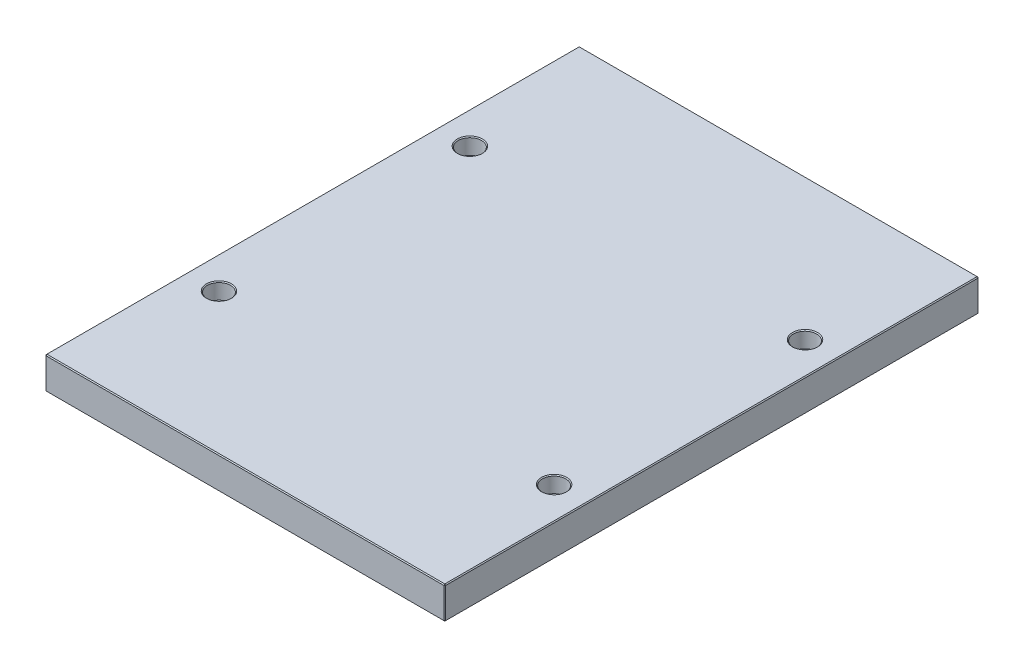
ISO-10303-21;
HEADER;
FILE_DESCRIPTION(('STEP AP214'),'2;1');
FILE_NAME('part.step','',(''),(''),'','','');
FILE_SCHEMA(('AUTOMOTIVE_DESIGN { 1 0 10303 214 1 1 1 1 }'));
ENDSEC;
DATA;
#1=APPLICATION_CONTEXT('core data for automotive mechanical design processes');
#2=APPLICATION_PROTOCOL_DEFINITION('international standard','automotive_design',2000,#1);
#3=PRODUCT_CONTEXT('',#1,'mechanical');
#4=PRODUCT('Part','Part','',(#3));
#5=PRODUCT_RELATED_PRODUCT_CATEGORY('part','',(#4));
#6=PRODUCT_DEFINITION_FORMATION('','',#4);
#7=PRODUCT_DEFINITION_CONTEXT('part definition',#1,'design');
#8=PRODUCT_DEFINITION('design','',#6,#7);
#9=PRODUCT_DEFINITION_SHAPE('','',#8);
#10=(LENGTH_UNIT() NAMED_UNIT(*) SI_UNIT(.MILLI.,.METRE.));
#11=(NAMED_UNIT(*) PLANE_ANGLE_UNIT() SI_UNIT($,.RADIAN.));
#12=(NAMED_UNIT(*) SI_UNIT($,.STERADIAN.) SOLID_ANGLE_UNIT());
#13=UNCERTAINTY_MEASURE_WITH_UNIT(LENGTH_MEASURE(1.E-05),#10,'distance_accuracy_value','');
#14=(GEOMETRIC_REPRESENTATION_CONTEXT(3) GLOBAL_UNCERTAINTY_ASSIGNED_CONTEXT((#13)) GLOBAL_UNIT_ASSIGNED_CONTEXT((#10,
#11,#12)) REPRESENTATION_CONTEXT('',''));
#15=CARTESIAN_POINT('',(0.,0.,0.));
#16=DIRECTION('',(0.,0.,1.));
#17=DIRECTION('',(1.,0.,0.));
#18=AXIS2_PLACEMENT_3D('',#15,#16,#17);
#19=CARTESIAN_POINT('',(-223.,36.,298.));
#20=DIRECTION('',(1.,0.,0.));
#21=DIRECTION('',(0.,0.,-1.));
#22=AXIS2_PLACEMENT_3D('',#19,#20,#21);
#23=PLANE('',#22);
#24=DIRECTION('',(0.,-1.,0.));
#25=VECTOR('',#24,1.);
#26=CARTESIAN_POINT('',(-223.,36.,-297.));
#27=LINE('',#26,#25);
#28=CARTESIAN_POINT('',(-223.,35.,-297.));
#29=VERTEX_POINT('',#28);
#30=CARTESIAN_POINT('',(-223.,1.00000000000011,-297.));
#31=VERTEX_POINT('',#30);
#32=EDGE_CURVE('E115',#29,#31,#27,.T.);
#33=ORIENTED_EDGE('',*,*,#32,.T.);
#34=DIRECTION('',(0.,0.,1.));
#35=VECTOR('',#34,1.);
#36=CARTESIAN_POINT('',(-223.,1.00000000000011,298.));
#37=LINE('',#36,#35);
#38=CARTESIAN_POINT('',(-223.,1.00000000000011,297.));
#39=VERTEX_POINT('',#38);
#40=EDGE_CURVE('E111',#31,#39,#37,.T.);
#41=ORIENTED_EDGE('',*,*,#40,.T.);
#42=DIRECTION('',(0.,1.,0.));
#43=VECTOR('',#42,1.);
#44=CARTESIAN_POINT('',(-223.,36.,297.));
#45=LINE('',#44,#43);
#46=CARTESIAN_POINT('',(-223.,35.,297.));
#47=VERTEX_POINT('',#46);
#48=EDGE_CURVE('E104',#39,#47,#45,.T.);
#49=ORIENTED_EDGE('',*,*,#48,.T.);
#50=DIRECTION('',(0.,0.,-1.));
#51=VECTOR('',#50,1.);
#52=CARTESIAN_POINT('',(-223.,35.,-298.));
#53=LINE('',#52,#51);
#54=EDGE_CURVE('E108',#47,#29,#53,.T.);
#55=ORIENTED_EDGE('',*,*,#54,.T.);
#56=EDGE_LOOP('',(#33,#41,#49,#55));
#57=FACE_BOUND('',#56,.T.);
#58=ADVANCED_FACE('F16',(#57),#23,.F.);
#59=CARTESIAN_POINT('',(223.,36.,298.));
#60=DIRECTION('',(0.,0.,-1.));
#61=DIRECTION('',(-1.,0.,0.));
#62=AXIS2_PLACEMENT_3D('',#59,#60,#61);
#63=PLANE('',#62);
#64=DIRECTION('',(-1.,0.,0.));
#65=VECTOR('',#64,1.);
#66=CARTESIAN_POINT('',(-223.,35.,298.));
#67=LINE('',#66,#65);
#68=CARTESIAN_POINT('',(222.,35.,298.));
#69=VERTEX_POINT('',#68);
#70=CARTESIAN_POINT('',(-222.,35.,298.));
#71=VERTEX_POINT('',#70);
#72=EDGE_CURVE('E170',#69,#71,#67,.T.);
#73=ORIENTED_EDGE('',*,*,#72,.T.);
#74=DIRECTION('',(0.,-1.,0.));
#75=VECTOR('',#74,1.);
#76=CARTESIAN_POINT('',(-222.,36.,298.));
#77=LINE('',#76,#75);
#78=CARTESIAN_POINT('',(-222.,1.,298.));
#79=VERTEX_POINT('',#78);
#80=EDGE_CURVE('E123',#71,#79,#77,.T.);
#81=ORIENTED_EDGE('',*,*,#80,.T.);
#82=DIRECTION('',(1.,0.,0.));
#83=VECTOR('',#82,1.);
#84=CARTESIAN_POINT('',(223.,1.,298.));
#85=LINE('',#84,#83);
#86=CARTESIAN_POINT('',(222.,1.,298.));
#87=VERTEX_POINT('',#86);
#88=EDGE_CURVE('E174',#79,#87,#85,.T.);
#89=ORIENTED_EDGE('',*,*,#88,.T.);
#90=DIRECTION('',(0.,1.,0.));
#91=VECTOR('',#90,1.);
#92=CARTESIAN_POINT('',(222.,36.,298.));
#93=LINE('',#92,#91);
#94=EDGE_CURVE('E172',#87,#69,#93,.T.);
#95=ORIENTED_EDGE('',*,*,#94,.T.);
#96=EDGE_LOOP('',(#73,#81,#89,#95));
#97=FACE_BOUND('',#96,.T.);
#98=ADVANCED_FACE('F317',(#97),#63,.F.);
#99=CARTESIAN_POINT('',(223.,36.,298.));
#100=DIRECTION('',(-1.,0.,0.));
#101=DIRECTION('',(0.,0.,1.));
#102=AXIS2_PLACEMENT_3D('',#99,#100,#101);
#103=PLANE('',#102);
#104=DIRECTION('',(0.,0.,-1.));
#105=VECTOR('',#104,1.);
#106=CARTESIAN_POINT('',(223.,1.,298.));
#107=LINE('',#106,#105);
#108=CARTESIAN_POINT('',(223.,1.,297.));
#109=VERTEX_POINT('',#108);
#110=CARTESIAN_POINT('',(223.,1.,-297.));
#111=VERTEX_POINT('',#110);
#112=EDGE_CURVE('E165',#109,#111,#107,.T.);
#113=ORIENTED_EDGE('',*,*,#112,.T.);
#114=DIRECTION('',(0.,1.,0.));
#115=VECTOR('',#114,1.);
#116=CARTESIAN_POINT('',(223.,36.,-297.));
#117=LINE('',#116,#115);
#118=CARTESIAN_POINT('',(223.,35.,-297.));
#119=VERTEX_POINT('',#118);
#120=EDGE_CURVE('E167',#111,#119,#117,.T.);
#121=ORIENTED_EDGE('',*,*,#120,.T.);
#122=DIRECTION('',(0.,0.,1.));
#123=VECTOR('',#122,1.);
#124=CARTESIAN_POINT('',(223.,35.,298.));
#125=LINE('',#124,#123);
#126=CARTESIAN_POINT('',(223.,35.,297.));
#127=VERTEX_POINT('',#126);
#128=EDGE_CURVE('E161',#119,#127,#125,.T.);
#129=ORIENTED_EDGE('',*,*,#128,.T.);
#130=DIRECTION('',(0.,-1.,0.));
#131=VECTOR('',#130,1.);
#132=CARTESIAN_POINT('',(223.,36.,297.));
#133=LINE('',#132,#131);
#134=EDGE_CURVE('E163',#127,#109,#133,.T.);
#135=ORIENTED_EDGE('',*,*,#134,.T.);
#136=EDGE_LOOP('',(#113,#121,#129,#135));
#137=FACE_BOUND('',#136,.T.);
#138=ADVANCED_FACE('F323',(#137),#103,.F.);
#139=CARTESIAN_POINT('',(223.,36.,-298.));
#140=DIRECTION('',(0.,0.,1.));
#141=DIRECTION('',(1.,0.,0.));
#142=AXIS2_PLACEMENT_3D('',#139,#140,#141);
#143=PLANE('',#142);
#144=DIRECTION('',(0.,-1.,0.));
#145=VECTOR('',#144,1.);
#146=CARTESIAN_POINT('',(222.,36.,-298.));
#147=LINE('',#146,#145);
#148=CARTESIAN_POINT('',(222.,35.,-298.));
#149=VERTEX_POINT('',#148);
#150=CARTESIAN_POINT('',(222.,1.,-298.));
#151=VERTEX_POINT('',#150);
#152=EDGE_CURVE('E154',#149,#151,#147,.T.);
#153=ORIENTED_EDGE('',*,*,#152,.T.);
#154=DIRECTION('',(-1.,0.,0.));
#155=VECTOR('',#154,1.);
#156=CARTESIAN_POINT('',(223.,1.,-298.));
#157=LINE('',#156,#155);
#158=CARTESIAN_POINT('',(-222.,1.,-298.));
#159=VERTEX_POINT('',#158);
#160=EDGE_CURVE('E159',#151,#159,#157,.T.);
#161=ORIENTED_EDGE('',*,*,#160,.T.);
#162=DIRECTION('',(0.,1.,0.));
#163=VECTOR('',#162,1.);
#164=CARTESIAN_POINT('',(-222.,36.,-298.));
#165=LINE('',#164,#163);
#166=CARTESIAN_POINT('',(-222.,35.,-298.));
#167=VERTEX_POINT('',#166);
#168=EDGE_CURVE('E156',#159,#167,#165,.T.);
#169=ORIENTED_EDGE('',*,*,#168,.T.);
#170=DIRECTION('',(1.,0.,0.));
#171=VECTOR('',#170,1.);
#172=CARTESIAN_POINT('',(223.,35.,-298.));
#173=LINE('',#172,#171);
#174=EDGE_CURVE('E152',#167,#149,#173,.T.);
#175=ORIENTED_EDGE('',*,*,#174,.T.);
#176=EDGE_LOOP('',(#153,#161,#169,#175));
#177=FACE_BOUND('',#176,.T.);
#178=ADVANCED_FACE('F465',(#177),#143,.F.);
#179=CARTESIAN_POINT('',(0.,36.,0.));
#180=DIRECTION('',(0.,1.,0.));
#181=DIRECTION('',(0.,0.,1.));
#182=AXIS2_PLACEMENT_3D('',#179,#180,#181);
#183=PLANE('',#182);
#184=CARTESIAN_POINT('',(-187.,36.,140.));
#185=DIRECTION('',(0.,1.,0.));
#186=DIRECTION('',(0.,0.,1.));
#187=AXIS2_PLACEMENT_3D('',#184,#185,#186);
#188=CIRCLE('',#187,14.);
#189=CARTESIAN_POINT('',(-187.,36.,154.));
#190=VERTEX_POINT('',#189);
#191=EDGE_CURVE('E290',#190,#190,#188,.F.);
#192=ORIENTED_EDGE('',*,*,#191,.T.);
#193=EDGE_LOOP('',(#192));
#194=FACE_BOUND('',#193,.T.);
#195=CARTESIAN_POINT('',(187.,36.,140.));
#196=DIRECTION('',(0.,1.,0.));
#197=DIRECTION('',(0.,0.,1.));
#198=AXIS2_PLACEMENT_3D('',#195,#196,#197);
#199=CIRCLE('',#198,14.);
#200=CARTESIAN_POINT('',(187.,36.,154.));
#201=VERTEX_POINT('',#200);
#202=EDGE_CURVE('E287',#201,#201,#199,.F.);
#203=ORIENTED_EDGE('',*,*,#202,.T.);
#204=EDGE_LOOP('',(#203));
#205=FACE_BOUND('',#204,.T.);
#206=CARTESIAN_POINT('',(187.,36.,-140.));
#207=DIRECTION('',(0.,1.,0.));
#208=DIRECTION('',(0.,0.,1.));
#209=AXIS2_PLACEMENT_3D('',#206,#207,#208);
#210=CIRCLE('',#209,14.);
#211=CARTESIAN_POINT('',(187.,36.,-126.));
#212=VERTEX_POINT('',#211);
#213=EDGE_CURVE('E284',#212,#212,#210,.F.);
#214=ORIENTED_EDGE('',*,*,#213,.T.);
#215=EDGE_LOOP('',(#214));
#216=FACE_BOUND('',#215,.T.);
#217=CARTESIAN_POINT('',(-187.,36.,-140.));
#218=DIRECTION('',(0.,1.,0.));
#219=DIRECTION('',(0.,0.,1.));
#220=AXIS2_PLACEMENT_3D('',#217,#218,#219);
#221=CIRCLE('',#220,14.);
#222=CARTESIAN_POINT('',(-187.,36.,-126.));
#223=VERTEX_POINT('',#222);
#224=EDGE_CURVE('E281',#223,#223,#221,.F.);
#225=ORIENTED_EDGE('',*,*,#224,.T.);
#226=EDGE_LOOP('',(#225));
#227=FACE_BOUND('',#226,.T.);
#228=DIRECTION('',(0.,0.,-1.));
#229=VECTOR('',#228,1.);
#230=CARTESIAN_POINT('',(222.,36.,-298.));
#231=LINE('',#230,#229);
#232=CARTESIAN_POINT('',(222.,36.,297.));
#233=VERTEX_POINT('',#232);
#234=CARTESIAN_POINT('',(222.,36.,-297.));
#235=VERTEX_POINT('',#234);
#236=EDGE_CURVE('E31',#233,#235,#231,.T.);
#237=ORIENTED_EDGE('',*,*,#236,.T.);
#238=DIRECTION('',(-1.,0.,0.));
#239=VECTOR('',#238,1.);
#240=CARTESIAN_POINT('',(-223.,36.,-297.));
#241=LINE('',#240,#239);
#242=CARTESIAN_POINT('',(-222.,36.,-297.));
#243=VERTEX_POINT('',#242);
#244=EDGE_CURVE('E190',#235,#243,#241,.T.);
#245=ORIENTED_EDGE('',*,*,#244,.T.);
#246=DIRECTION('',(0.,0.,1.));
#247=VECTOR('',#246,1.);
#248=CARTESIAN_POINT('',(-222.,36.,298.));
#249=LINE('',#248,#247);
#250=CARTESIAN_POINT('',(-222.,36.,297.));
#251=VERTEX_POINT('',#250);
#252=EDGE_CURVE('E186',#243,#251,#249,.T.);
#253=ORIENTED_EDGE('',*,*,#252,.T.);
#254=DIRECTION('',(1.,0.,0.));
#255=VECTOR('',#254,1.);
#256=CARTESIAN_POINT('',(223.,36.,297.));
#257=LINE('',#256,#255);
#258=EDGE_CURVE('E36',#251,#233,#257,.T.);
#259=ORIENTED_EDGE('',*,*,#258,.T.);
#260=EDGE_LOOP('',(#237,#245,#253,#259));
#261=FACE_BOUND('',#260,.T.);
#262=ADVANCED_FACE('F462',(#194,#205,#216,#227,#261),#183,.T.);
#263=CARTESIAN_POINT('',(0.,0.,0.));
#264=DIRECTION('',(0.,1.,0.));
#265=DIRECTION('',(0.,0.,1.));
#266=AXIS2_PLACEMENT_3D('',#263,#264,#265);
#267=PLANE('',#266);
#268=CARTESIAN_POINT('',(187.,0.,-140.));
#269=DIRECTION('',(0.,1.,0.));
#270=DIRECTION('',(0.,0.,1.));
#271=AXIS2_PLACEMENT_3D('',#268,#269,#270);
#272=CIRCLE('',#271,10.);
#273=CARTESIAN_POINT('',(187.,0.,-130.));
#274=VERTEX_POINT('',#273);
#275=EDGE_CURVE('E263',#274,#274,#272,.T.);
#276=ORIENTED_EDGE('',*,*,#275,.T.);
#277=EDGE_LOOP('',(#276));
#278=FACE_BOUND('',#277,.T.);
#279=CARTESIAN_POINT('',(187.,0.,140.));
#280=DIRECTION('',(0.,1.,0.));
#281=DIRECTION('',(0.,0.,1.));
#282=AXIS2_PLACEMENT_3D('',#279,#280,#281);
#283=CIRCLE('',#282,10.);
#284=CARTESIAN_POINT('',(187.,0.,150.));
#285=VERTEX_POINT('',#284);
#286=EDGE_CURVE('E260',#285,#285,#283,.T.);
#287=ORIENTED_EDGE('',*,*,#286,.T.);
#288=EDGE_LOOP('',(#287));
#289=FACE_BOUND('',#288,.T.);
#290=CARTESIAN_POINT('',(-187.,0.,140.));
#291=DIRECTION('',(0.,1.,0.));
#292=DIRECTION('',(0.,0.,1.));
#293=AXIS2_PLACEMENT_3D('',#290,#291,#292);
#294=CIRCLE('',#293,10.);
#295=CARTESIAN_POINT('',(-187.,0.,150.));
#296=VERTEX_POINT('',#295);
#297=EDGE_CURVE('E257',#296,#296,#294,.T.);
#298=ORIENTED_EDGE('',*,*,#297,.T.);
#299=EDGE_LOOP('',(#298));
#300=FACE_BOUND('',#299,.T.);
#301=CARTESIAN_POINT('',(-187.,0.,-140.));
#302=DIRECTION('',(0.,1.,0.));
#303=DIRECTION('',(0.,0.,1.));
#304=AXIS2_PLACEMENT_3D('',#301,#302,#303);
#305=CIRCLE('',#304,10.);
#306=CARTESIAN_POINT('',(-187.,0.,-130.));
#307=VERTEX_POINT('',#306);
#308=EDGE_CURVE('E192',#307,#307,#305,.T.);
#309=ORIENTED_EDGE('',*,*,#308,.T.);
#310=EDGE_LOOP('',(#309));
#311=FACE_BOUND('',#310,.T.);
#312=DIRECTION('',(0.,0.,1.));
#313=VECTOR('',#312,1.);
#314=CARTESIAN_POINT('',(222.,0.,0.));
#315=LINE('',#314,#313);
#316=CARTESIAN_POINT('',(222.,0.,-297.));
#317=VERTEX_POINT('',#316);
#318=CARTESIAN_POINT('',(222.,0.,297.));
#319=VERTEX_POINT('',#318);
#320=EDGE_CURVE('E177',#317,#319,#315,.T.);
#321=ORIENTED_EDGE('',*,*,#320,.T.);
#322=DIRECTION('',(-1.,0.,0.));
#323=VECTOR('',#322,1.);
#324=CARTESIAN_POINT('',(0.,0.,297.));
#325=LINE('',#324,#323);
#326=CARTESIAN_POINT('',(-222.,0.,297.));
#327=VERTEX_POINT('',#326);
#328=EDGE_CURVE('E183',#319,#327,#325,.T.);
#329=ORIENTED_EDGE('',*,*,#328,.T.);
#330=DIRECTION('',(0.,0.,-1.));
#331=VECTOR('',#330,1.);
#332=CARTESIAN_POINT('',(-222.,0.,0.));
#333=LINE('',#332,#331);
#334=CARTESIAN_POINT('',(-222.,0.,-297.));
#335=VERTEX_POINT('',#334);
#336=EDGE_CURVE('E181',#327,#335,#333,.T.);
#337=ORIENTED_EDGE('',*,*,#336,.T.);
#338=DIRECTION('',(1.,0.,0.));
#339=VECTOR('',#338,1.);
#340=CARTESIAN_POINT('',(0.,0.,-297.));
#341=LINE('',#340,#339);
#342=EDGE_CURVE('E179',#335,#317,#341,.T.);
#343=ORIENTED_EDGE('',*,*,#342,.T.);
#344=EDGE_LOOP('',(#321,#329,#337,#343));
#345=FACE_BOUND('',#344,.T.);
#346=ADVANCED_FACE('F402',(#278,#289,#300,#311,#345),#267,.F.);
#347=CARTESIAN_POINT('',(223.,36.,297.));
#348=DIRECTION('',(-0.707106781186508,0.,-0.707106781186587));
#349=DIRECTION('',(0.,-1.,0.));
#350=AXIS2_PLACEMENT_3D('',#347,#348,#349);
#351=PLANE('',#350);
#352=DIRECTION('',(-0.707106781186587,0.,0.707106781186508));
#353=VECTOR('',#352,1.);
#354=CARTESIAN_POINT('',(222.,35.,298.));
#355=LINE('',#354,#353);
#356=EDGE_CURVE('E141',#69,#127,#355,.F.);
#357=ORIENTED_EDGE('',*,*,#356,.F.);
#358=ORIENTED_EDGE('',*,*,#94,.F.);
#359=DIRECTION('',(0.707106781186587,0.,-0.707106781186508));
#360=VECTOR('',#359,1.);
#361=CARTESIAN_POINT('',(222.,1.,298.));
#362=LINE('',#361,#360);
#363=EDGE_CURVE('E144',#109,#87,#362,.F.);
#364=ORIENTED_EDGE('',*,*,#363,.F.);
#365=ORIENTED_EDGE('',*,*,#134,.F.);
#366=EDGE_LOOP('',(#357,#358,#364,#365));
#367=FACE_BOUND('',#366,.T.);
#368=ADVANCED_FACE('F398',(#367),#351,.F.);
#369=CARTESIAN_POINT('',(222.,35.,298.));
#370=DIRECTION('',(0.577350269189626,0.577350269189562,0.57735026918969));
#371=DIRECTION('',(0.707106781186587,0.,-0.707106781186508));
#372=AXIS2_PLACEMENT_3D('',#369,#370,#371);
#373=PLANE('',#372);
#374=DIRECTION('',(0.,-0.707106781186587,0.707106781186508));
#375=VECTOR('',#374,1.);
#376=CARTESIAN_POINT('',(222.,35.,298.));
#377=LINE('',#376,#375);
#378=EDGE_CURVE('E235',#69,#233,#377,.F.);
#379=ORIENTED_EDGE('',*,*,#378,.F.);
#380=ORIENTED_EDGE('',*,*,#356,.T.);
#381=DIRECTION('',(-0.707106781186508,0.707106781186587,0.));
#382=VECTOR('',#381,1.);
#383=CARTESIAN_POINT('',(222.5,35.5,297.));
#384=LINE('',#383,#382);
#385=EDGE_CURVE('E237',#233,#127,#384,.F.);
#386=ORIENTED_EDGE('',*,*,#385,.F.);
#387=EDGE_LOOP('',(#379,#380,#386));
#388=FACE_BOUND('',#387,.T.);
#389=ADVANCED_FACE('F394',(#388),#373,.T.);
#390=CARTESIAN_POINT('',(222.,1.,298.));
#391=DIRECTION('',(0.577350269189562,-0.57735026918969,0.577350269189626));
#392=DIRECTION('',(0.,-0.707106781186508,-0.707106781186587));
#393=AXIS2_PLACEMENT_3D('',#390,#391,#392);
#394=PLANE('',#393);
#395=DIRECTION('',(-0.707106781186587,-0.707106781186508,0.));
#396=VECTOR('',#395,1.);
#397=CARTESIAN_POINT('',(222.5,0.5,297.));
#398=LINE('',#397,#396);
#399=EDGE_CURVE('E229',#109,#319,#398,.T.);
#400=ORIENTED_EDGE('',*,*,#399,.F.);
#401=ORIENTED_EDGE('',*,*,#363,.T.);
#402=DIRECTION('',(0.,0.707106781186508,0.707106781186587));
#403=VECTOR('',#402,1.);
#404=CARTESIAN_POINT('',(222.,1.,298.));
#405=LINE('',#404,#403);
#406=EDGE_CURVE('E232',#319,#87,#405,.T.);
#407=ORIENTED_EDGE('',*,*,#406,.F.);
#408=EDGE_LOOP('',(#400,#401,#407));
#409=FACE_BOUND('',#408,.T.);
#410=ADVANCED_FACE('F390',(#409),#394,.T.);
#411=CARTESIAN_POINT('',(222.,36.,0.));
#412=DIRECTION('',(0.707106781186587,0.707106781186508,0.));
#413=DIRECTION('',(0.,0.,1.));
#414=AXIS2_PLACEMENT_3D('',#411,#412,#413);
#415=PLANE('',#414);
#416=ORIENTED_EDGE('',*,*,#385,.T.);
#417=ORIENTED_EDGE('',*,*,#128,.F.);
#418=DIRECTION('',(0.707106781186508,-0.707106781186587,1.57020284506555E-13));
#419=VECTOR('',#418,1.);
#420=CARTESIAN_POINT('',(223.,35.,-297.));
#421=LINE('',#420,#419);
#422=EDGE_CURVE('E224',#235,#119,#421,.T.);
#423=ORIENTED_EDGE('',*,*,#422,.F.);
#424=ORIENTED_EDGE('',*,*,#236,.F.);
#425=EDGE_LOOP('',(#416,#417,#423,#424));
#426=FACE_BOUND('',#425,.T.);
#427=ADVANCED_FACE('F386',(#426),#415,.T.);
#428=CARTESIAN_POINT('',(0.,36.,297.));
#429=DIRECTION('',(0.,0.707106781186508,0.707106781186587));
#430=DIRECTION('',(-1.,0.,0.));
#431=AXIS2_PLACEMENT_3D('',#428,#429,#430);
#432=PLANE('',#431);
#433=ORIENTED_EDGE('',*,*,#378,.T.);
#434=ORIENTED_EDGE('',*,*,#258,.F.);
#435=DIRECTION('',(0.,0.707106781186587,-0.707106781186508));
#436=VECTOR('',#435,1.);
#437=CARTESIAN_POINT('',(-222.,35.5,297.5));
#438=LINE('',#437,#436);
#439=EDGE_CURVE('E127',#71,#251,#438,.T.);
#440=ORIENTED_EDGE('',*,*,#439,.F.);
#441=ORIENTED_EDGE('',*,*,#72,.F.);
#442=EDGE_LOOP('',(#433,#434,#440,#441));
#443=FACE_BOUND('',#442,.T.);
#444=ADVANCED_FACE('F383',(#443),#432,.T.);
#445=CARTESIAN_POINT('',(-222.,36.,298.));
#446=DIRECTION('',(0.707106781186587,0.,-0.707106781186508));
#447=DIRECTION('',(0.,-1.,0.));
#448=AXIS2_PLACEMENT_3D('',#445,#446,#447);
#449=PLANE('',#448);
#450=DIRECTION('',(0.707106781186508,0.,0.707106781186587));
#451=VECTOR('',#450,1.);
#452=CARTESIAN_POINT('',(-222.,1.,298.));
#453=LINE('',#452,#451);
#454=EDGE_CURVE('E128',#79,#39,#453,.F.);
#455=ORIENTED_EDGE('',*,*,#454,.F.);
#456=ORIENTED_EDGE('',*,*,#80,.F.);
#457=DIRECTION('',(-0.707106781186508,0.,-0.707106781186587));
#458=VECTOR('',#457,1.);
#459=CARTESIAN_POINT('',(-223.,35.,297.));
#460=LINE('',#459,#458);
#461=EDGE_CURVE('E119',#47,#71,#460,.F.);
#462=ORIENTED_EDGE('',*,*,#461,.F.);
#463=ORIENTED_EDGE('',*,*,#48,.F.);
#464=EDGE_LOOP('',(#455,#456,#462,#463));
#465=FACE_BOUND('',#464,.T.);
#466=ADVANCED_FACE('F121',(#465),#449,.F.);
#467=CARTESIAN_POINT('',(223.,1.,298.));
#468=DIRECTION('',(0.,0.707106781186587,-0.707106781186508));
#469=DIRECTION('',(1.,0.,0.));
#470=AXIS2_PLACEMENT_3D('',#467,#468,#469);
#471=PLANE('',#470);
#472=ORIENTED_EDGE('',*,*,#406,.T.);
#473=ORIENTED_EDGE('',*,*,#88,.F.);
#474=DIRECTION('',(0.,-0.707106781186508,-0.707106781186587));
#475=VECTOR('',#474,1.);
#476=CARTESIAN_POINT('',(-222.,1.,298.));
#477=LINE('',#476,#475);
#478=EDGE_CURVE('E220',#327,#79,#477,.F.);
#479=ORIENTED_EDGE('',*,*,#478,.F.);
#480=ORIENTED_EDGE('',*,*,#328,.F.);
#481=EDGE_LOOP('',(#472,#473,#479,#480));
#482=FACE_BOUND('',#481,.T.);
#483=ADVANCED_FACE('F376',(#482),#471,.F.);
#484=CARTESIAN_POINT('',(223.,1.,298.));
#485=DIRECTION('',(-0.707106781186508,0.707106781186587,0.));
#486=DIRECTION('',(0.,0.,-1.));
#487=AXIS2_PLACEMENT_3D('',#484,#485,#486);
#488=PLANE('',#487);
#489=ORIENTED_EDGE('',*,*,#399,.T.);
#490=ORIENTED_EDGE('',*,*,#320,.F.);
#491=DIRECTION('',(0.707106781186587,0.707106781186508,0.));
#492=VECTOR('',#491,1.);
#493=CARTESIAN_POINT('',(222.5,0.499999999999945,-297.));
#494=LINE('',#493,#492);
#495=EDGE_CURVE('E217',#111,#317,#494,.F.);
#496=ORIENTED_EDGE('',*,*,#495,.F.);
#497=ORIENTED_EDGE('',*,*,#112,.F.);
#498=EDGE_LOOP('',(#489,#490,#496,#497));
#499=FACE_BOUND('',#498,.T.);
#500=ADVANCED_FACE('F372',(#499),#488,.F.);
#501=CARTESIAN_POINT('',(222.,36.,-298.));
#502=DIRECTION('',(-0.707106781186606,0.,0.707106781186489));
#503=DIRECTION('',(0.,-1.,0.));
#504=AXIS2_PLACEMENT_3D('',#501,#502,#503);
#505=PLANE('',#504);
#506=DIRECTION('',(0.707106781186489,0.,0.707106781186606));
#507=VECTOR('',#506,1.);
#508=CARTESIAN_POINT('',(223.,35.,-297.));
#509=LINE('',#508,#507);
#510=EDGE_CURVE('E226',#119,#149,#509,.F.);
#511=ORIENTED_EDGE('',*,*,#510,.F.);
#512=ORIENTED_EDGE('',*,*,#120,.F.);
#513=DIRECTION('',(-0.707106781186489,0.,-0.707106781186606));
#514=VECTOR('',#513,1.);
#515=CARTESIAN_POINT('',(222.,1.,-298.));
#516=LINE('',#515,#514);
#517=EDGE_CURVE('E214',#151,#111,#516,.F.);
#518=ORIENTED_EDGE('',*,*,#517,.F.);
#519=ORIENTED_EDGE('',*,*,#152,.F.);
#520=EDGE_LOOP('',(#511,#512,#518,#519));
#521=FACE_BOUND('',#520,.T.);
#522=ADVANCED_FACE('F368',(#521),#505,.F.);
#523=CARTESIAN_POINT('',(223.,35.,-297.));
#524=DIRECTION('',(0.577350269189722,0.57735026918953,-0.577350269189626));
#525=DIRECTION('',(-0.707106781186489,0.,-0.707106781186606));
#526=AXIS2_PLACEMENT_3D('',#523,#524,#525);
#527=PLANE('',#526);
#528=ORIENTED_EDGE('',*,*,#422,.T.);
#529=ORIENTED_EDGE('',*,*,#510,.T.);
#530=DIRECTION('',(0.,0.707106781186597,0.707106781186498));
#531=VECTOR('',#530,1.);
#532=CARTESIAN_POINT('',(222.,35.5,-297.5));
#533=LINE('',#532,#531);
#534=EDGE_CURVE('E135',#235,#149,#533,.F.);
#535=ORIENTED_EDGE('',*,*,#534,.F.);
#536=EDGE_LOOP('',(#528,#529,#535));
#537=FACE_BOUND('',#536,.T.);
#538=ADVANCED_FACE('F365',(#537),#527,.T.);
#539=CARTESIAN_POINT('',(-223.,35.,297.));
#540=DIRECTION('',(-0.57735026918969,0.577350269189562,0.577350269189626));
#541=DIRECTION('',(0.707106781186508,0.,0.707106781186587));
#542=AXIS2_PLACEMENT_3D('',#539,#540,#541);
#543=PLANE('',#542);
#544=ORIENTED_EDGE('',*,*,#461,.T.);
#545=ORIENTED_EDGE('',*,*,#439,.T.);
#546=DIRECTION('',(-0.707106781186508,-0.707106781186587,0.));
#547=VECTOR('',#546,1.);
#548=CARTESIAN_POINT('',(-223.,35.,297.));
#549=LINE('',#548,#547);
#550=EDGE_CURVE('E131',#47,#251,#549,.F.);
#551=ORIENTED_EDGE('',*,*,#550,.F.);
#552=EDGE_LOOP('',(#544,#545,#551));
#553=FACE_BOUND('',#552,.T.);
#554=ADVANCED_FACE('F132',(#553),#543,.T.);
#555=CARTESIAN_POINT('',(-222.,1.,298.));
#556=DIRECTION('',(-0.57735026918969,-0.577350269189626,0.577350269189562));
#557=DIRECTION('',(0.707106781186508,-0.707106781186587,0.));
#558=AXIS2_PLACEMENT_3D('',#555,#556,#557);
#559=PLANE('',#558);
#560=ORIENTED_EDGE('',*,*,#478,.T.);
#561=ORIENTED_EDGE('',*,*,#454,.T.);
#562=DIRECTION('',(-0.707106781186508,0.707106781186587,0.));
#563=VECTOR('',#562,1.);
#564=CARTESIAN_POINT('',(-222.5,0.500000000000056,297.));
#565=LINE('',#564,#563);
#566=EDGE_CURVE('E136',#327,#39,#565,.T.);
#567=ORIENTED_EDGE('',*,*,#566,.F.);
#568=EDGE_LOOP('',(#560,#561,#567));
#569=FACE_BOUND('',#568,.T.);
#570=ADVANCED_FACE('F358',(#569),#559,.T.);
#571=CARTESIAN_POINT('',(222.,1.,-298.));
#572=DIRECTION('',(0.577350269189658,-0.577350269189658,-0.577350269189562));
#573=DIRECTION('',(0.707106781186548,0.707106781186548,0.));
#574=AXIS2_PLACEMENT_3D('',#571,#572,#573);
#575=PLANE('',#574);
#576=ORIENTED_EDGE('',*,*,#517,.T.);
#577=ORIENTED_EDGE('',*,*,#495,.T.);
#578=DIRECTION('',(0.,-0.707106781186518,0.707106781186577));
#579=VECTOR('',#578,1.);
#580=CARTESIAN_POINT('',(222.,1.,-298.));
#581=LINE('',#580,#579);
#582=EDGE_CURVE('E207',#151,#317,#581,.T.);
#583=ORIENTED_EDGE('',*,*,#582,.F.);
#584=EDGE_LOOP('',(#576,#577,#583));
#585=FACE_BOUND('',#584,.T.);
#586=ADVANCED_FACE('F354',(#585),#575,.T.);
#587=CARTESIAN_POINT('',(0.,36.,-297.));
#588=DIRECTION('',(0.,0.707106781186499,-0.707106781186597));
#589=DIRECTION('',(1.,0.,0.));
#590=AXIS2_PLACEMENT_3D('',#587,#588,#589);
#591=PLANE('',#590);
#592=ORIENTED_EDGE('',*,*,#534,.T.);
#593=ORIENTED_EDGE('',*,*,#174,.F.);
#594=DIRECTION('',(0.,-0.707106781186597,-0.707106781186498));
#595=VECTOR('',#594,1.);
#596=CARTESIAN_POINT('',(-222.,35.,-298.));
#597=LINE('',#596,#595);
#598=EDGE_CURVE('E204',#243,#167,#597,.T.);
#599=ORIENTED_EDGE('',*,*,#598,.F.);
#600=ORIENTED_EDGE('',*,*,#244,.F.);
#601=EDGE_LOOP('',(#592,#593,#599,#600));
#602=FACE_BOUND('',#601,.T.);
#603=ADVANCED_FACE('F351',(#602),#591,.T.);
#604=CARTESIAN_POINT('',(-222.,36.,0.));
#605=DIRECTION('',(-0.707106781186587,0.707106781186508,0.));
#606=DIRECTION('',(0.,0.,-1.));
#607=AXIS2_PLACEMENT_3D('',#604,#605,#606);
#608=PLANE('',#607);
#609=ORIENTED_EDGE('',*,*,#550,.T.);
#610=ORIENTED_EDGE('',*,*,#252,.F.);
#611=DIRECTION('',(0.707106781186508,0.707106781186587,-1.1767550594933E-13));
#612=VECTOR('',#611,1.);
#613=CARTESIAN_POINT('',(-222.5,35.5,-297.));
#614=LINE('',#613,#612);
#615=EDGE_CURVE('E139',#29,#243,#614,.T.);
#616=ORIENTED_EDGE('',*,*,#615,.F.);
#617=ORIENTED_EDGE('',*,*,#54,.F.);
#618=EDGE_LOOP('',(#609,#610,#616,#617));
#619=FACE_BOUND('',#618,.T.);
#620=ADVANCED_FACE('F138',(#619),#608,.T.);
#621=CARTESIAN_POINT('',(-223.,1.00000000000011,298.));
#622=DIRECTION('',(0.707106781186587,0.707106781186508,0.));
#623=DIRECTION('',(0.,0.,1.));
#624=AXIS2_PLACEMENT_3D('',#621,#622,#623);
#625=PLANE('',#624);
#626=ORIENTED_EDGE('',*,*,#566,.T.);
#627=ORIENTED_EDGE('',*,*,#40,.F.);
#628=DIRECTION('',(0.707106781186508,-0.707106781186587,0.));
#629=VECTOR('',#628,1.);
#630=CARTESIAN_POINT('',(-223.,1.00000000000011,-297.));
#631=LINE('',#630,#629);
#632=EDGE_CURVE('E200',#335,#31,#631,.F.);
#633=ORIENTED_EDGE('',*,*,#632,.F.);
#634=ORIENTED_EDGE('',*,*,#336,.F.);
#635=EDGE_LOOP('',(#626,#627,#633,#634));
#636=FACE_BOUND('',#635,.T.);
#637=ADVANCED_FACE('F344',(#636),#625,.F.);
#638=CARTESIAN_POINT('',(223.,1.,-298.));
#639=DIRECTION('',(0.,0.707106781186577,0.707106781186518));
#640=DIRECTION('',(-1.,0.,0.));
#641=AXIS2_PLACEMENT_3D('',#638,#639,#640);
#642=PLANE('',#641);
#643=ORIENTED_EDGE('',*,*,#582,.T.);
#644=ORIENTED_EDGE('',*,*,#342,.F.);
#645=DIRECTION('',(0.,0.707106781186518,-0.707106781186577));
#646=VECTOR('',#645,1.);
#647=CARTESIAN_POINT('',(-222.,0.499999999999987,-297.5));
#648=LINE('',#647,#646);
#649=EDGE_CURVE('E197',#159,#335,#648,.F.);
#650=ORIENTED_EDGE('',*,*,#649,.F.);
#651=ORIENTED_EDGE('',*,*,#160,.F.);
#652=EDGE_LOOP('',(#643,#644,#650,#651));
#653=FACE_BOUND('',#652,.T.);
#654=ADVANCED_FACE('F340',(#653),#642,.F.);
#655=CARTESIAN_POINT('',(-222.,35.,-298.));
#656=DIRECTION('',(-0.577350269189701,0.57735026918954,-0.577350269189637));
#657=DIRECTION('',(-0.707106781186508,0.,0.707106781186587));
#658=AXIS2_PLACEMENT_3D('',#655,#656,#657);
#659=PLANE('',#658);
#660=ORIENTED_EDGE('',*,*,#615,.T.);
#661=ORIENTED_EDGE('',*,*,#598,.T.);
#662=DIRECTION('',(0.707106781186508,0.,-0.707106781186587));
#663=VECTOR('',#662,1.);
#664=CARTESIAN_POINT('',(-222.,35.,-298.));
#665=LINE('',#664,#663);
#666=EDGE_CURVE('E195',#29,#167,#665,.T.);
#667=ORIENTED_EDGE('',*,*,#666,.F.);
#668=EDGE_LOOP('',(#660,#661,#667));
#669=FACE_BOUND('',#668,.T.);
#670=ADVANCED_FACE('F336',(#669),#659,.T.);
#671=CARTESIAN_POINT('',(-223.,1.00000000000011,-297.));
#672=DIRECTION('',(-0.577350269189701,-0.577350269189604,-0.577350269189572));
#673=DIRECTION('',(0.707106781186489,-0.707106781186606,0.));
#674=AXIS2_PLACEMENT_3D('',#671,#672,#673);
#675=PLANE('',#674);
#676=ORIENTED_EDGE('',*,*,#649,.T.);
#677=ORIENTED_EDGE('',*,*,#632,.T.);
#678=DIRECTION('',(-0.707106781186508,0.,0.707106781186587));
#679=VECTOR('',#678,1.);
#680=CARTESIAN_POINT('',(-223.,1.00000000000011,-297.));
#681=LINE('',#680,#679);
#682=EDGE_CURVE('E193',#159,#31,#681,.T.);
#683=ORIENTED_EDGE('',*,*,#682,.F.);
#684=EDGE_LOOP('',(#676,#677,#683));
#685=FACE_BOUND('',#684,.T.);
#686=ADVANCED_FACE('F332',(#685),#675,.T.);
#687=CARTESIAN_POINT('',(-223.,36.,-297.));
#688=DIRECTION('',(0.707106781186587,0.,0.707106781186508));
#689=DIRECTION('',(0.,-1.,0.));
#690=AXIS2_PLACEMENT_3D('',#687,#688,#689);
#691=PLANE('',#690);
#692=ORIENTED_EDGE('',*,*,#666,.T.);
#693=ORIENTED_EDGE('',*,*,#168,.F.);
#694=ORIENTED_EDGE('',*,*,#682,.T.);
#695=ORIENTED_EDGE('',*,*,#32,.F.);
#696=EDGE_LOOP('',(#692,#693,#694,#695));
#697=FACE_BOUND('',#696,.T.);
#698=ADVANCED_FACE('F328',(#697),#691,.F.);
#699=CARTESIAN_POINT('',(-187.,18.,-140.));
#700=DIRECTION('',(0.,1.,0.));
#701=DIRECTION('',(0.,0.,1.));
#702=AXIS2_PLACEMENT_3D('',#699,#700,#701);
#703=CYLINDRICAL_SURFACE('',#702,13.);
#704=CARTESIAN_POINT('',(-187.,35.,-140.));
#705=DIRECTION('',(0.,1.,0.));
#706=DIRECTION('',(0.,0.,1.));
#707=AXIS2_PLACEMENT_3D('',#704,#705,#706);
#708=CIRCLE('',#707,13.);
#709=CARTESIAN_POINT('',(-187.,35.,-127.));
#710=VERTEX_POINT('',#709);
#711=EDGE_CURVE('E10',#710,#710,#708,.T.);
#712=ORIENTED_EDGE('',*,*,#711,.T.);
#713=EDGE_LOOP('',(#712));
#714=FACE_BOUND('',#713,.T.);
#715=CARTESIAN_POINT('',(-187.,18.,-140.));
#716=DIRECTION('',(0.,1.,0.));
#717=DIRECTION('',(0.,0.,1.));
#718=AXIS2_PLACEMENT_3D('',#715,#716,#717);
#719=CIRCLE('',#718,13.);
#720=CARTESIAN_POINT('',(-187.,18.,-127.));
#721=VERTEX_POINT('',#720);
#722=EDGE_CURVE('E147',#721,#721,#719,.T.);
#723=ORIENTED_EDGE('',*,*,#722,.F.);
#724=EDGE_LOOP('',(#723));
#725=FACE_BOUND('',#724,.T.);
#726=ADVANCED_FACE('F331',(#714,#725),#703,.F.);
#727=CARTESIAN_POINT('',(-187.,18.,-140.));
#728=DIRECTION('',(0.,1.,0.));
#729=DIRECTION('',(0.,0.,1.));
#730=AXIS2_PLACEMENT_3D('',#727,#728,#729);
#731=PLANE('',#730);
#732=CARTESIAN_POINT('',(-187.,18.,-140.));
#733=DIRECTION('',(0.,1.,0.));
#734=DIRECTION('',(0.,0.,1.));
#735=AXIS2_PLACEMENT_3D('',#732,#733,#734);
#736=CIRCLE('',#735,9.);
#737=CARTESIAN_POINT('',(-187.,18.,-131.));
#738=VERTEX_POINT('',#737);
#739=EDGE_CURVE('E251',#738,#738,#736,.T.);
#740=ORIENTED_EDGE('',*,*,#739,.F.);
#741=EDGE_LOOP('',(#740));
#742=FACE_BOUND('',#741,.T.);
#743=ORIENTED_EDGE('',*,*,#722,.T.);
#744=EDGE_LOOP('',(#743));
#745=FACE_BOUND('',#744,.T.);
#746=ADVANCED_FACE('F450',(#742,#745),#731,.T.);
#747=CARTESIAN_POINT('',(187.,18.,-140.));
#748=DIRECTION('',(0.,1.,0.));
#749=DIRECTION('',(0.,0.,1.));
#750=AXIS2_PLACEMENT_3D('',#747,#748,#749);
#751=CYLINDRICAL_SURFACE('',#750,13.);
#752=CARTESIAN_POINT('',(187.,35.,-140.));
#753=DIRECTION('',(0.,1.,0.));
#754=DIRECTION('',(0.,0.,1.));
#755=AXIS2_PLACEMENT_3D('',#752,#753,#754);
#756=CIRCLE('',#755,13.);
#757=CARTESIAN_POINT('',(187.,35.,-127.));
#758=VERTEX_POINT('',#757);
#759=EDGE_CURVE('E24',#758,#758,#756,.T.);
#760=ORIENTED_EDGE('',*,*,#759,.T.);
#761=EDGE_LOOP('',(#760));
#762=FACE_BOUND('',#761,.T.);
#763=CARTESIAN_POINT('',(187.,18.,-140.));
#764=DIRECTION('',(0.,1.,0.));
#765=DIRECTION('',(0.,0.,1.));
#766=AXIS2_PLACEMENT_3D('',#763,#764,#765);
#767=CIRCLE('',#766,13.);
#768=CARTESIAN_POINT('',(187.,18.,-127.));
#769=VERTEX_POINT('',#768);
#770=EDGE_CURVE('E441',#769,#769,#767,.T.);
#771=ORIENTED_EDGE('',*,*,#770,.F.);
#772=EDGE_LOOP('',(#771));
#773=FACE_BOUND('',#772,.T.);
#774=ADVANCED_FACE('F298',(#762,#773),#751,.F.);
#775=CARTESIAN_POINT('',(187.,18.,-140.));
#776=DIRECTION('',(0.,1.,0.));
#777=DIRECTION('',(0.,0.,1.));
#778=AXIS2_PLACEMENT_3D('',#775,#776,#777);
#779=PLANE('',#778);
#780=CARTESIAN_POINT('',(187.,18.,-140.));
#781=DIRECTION('',(0.,1.,0.));
#782=DIRECTION('',(0.,0.,1.));
#783=AXIS2_PLACEMENT_3D('',#780,#781,#782);
#784=CIRCLE('',#783,9.);
#785=CARTESIAN_POINT('',(187.,18.,-131.));
#786=VERTEX_POINT('',#785);
#787=EDGE_CURVE('E248',#786,#786,#784,.T.);
#788=ORIENTED_EDGE('',*,*,#787,.F.);
#789=EDGE_LOOP('',(#788));
#790=FACE_BOUND('',#789,.T.);
#791=ORIENTED_EDGE('',*,*,#770,.T.);
#792=EDGE_LOOP('',(#791));
#793=FACE_BOUND('',#792,.T.);
#794=ADVANCED_FACE('F738',(#790,#793),#779,.T.);
#795=CARTESIAN_POINT('',(187.,18.,140.));
#796=DIRECTION('',(0.,1.,0.));
#797=DIRECTION('',(0.,0.,1.));
#798=AXIS2_PLACEMENT_3D('',#795,#796,#797);
#799=CYLINDRICAL_SURFACE('',#798,13.);
#800=CARTESIAN_POINT('',(187.,35.,140.));
#801=DIRECTION('',(0.,1.,0.));
#802=DIRECTION('',(0.,0.,1.));
#803=AXIS2_PLACEMENT_3D('',#800,#801,#802);
#804=CIRCLE('',#803,13.);
#805=CARTESIAN_POINT('',(187.,35.,153.));
#806=VERTEX_POINT('',#805);
#807=EDGE_CURVE('E293',#806,#806,#804,.T.);
#808=ORIENTED_EDGE('',*,*,#807,.T.);
#809=EDGE_LOOP('',(#808));
#810=FACE_BOUND('',#809,.T.);
#811=CARTESIAN_POINT('',(187.,18.,140.));
#812=DIRECTION('',(0.,1.,0.));
#813=DIRECTION('',(0.,0.,1.));
#814=AXIS2_PLACEMENT_3D('',#811,#812,#813);
#815=CIRCLE('',#814,13.);
#816=CARTESIAN_POINT('',(187.,18.,153.));
#817=VERTEX_POINT('',#816);
#818=EDGE_CURVE('E439',#817,#817,#815,.T.);
#819=ORIENTED_EDGE('',*,*,#818,.F.);
#820=EDGE_LOOP('',(#819));
#821=FACE_BOUND('',#820,.T.);
#822=ADVANCED_FACE('F730',(#810,#821),#799,.F.);
#823=CARTESIAN_POINT('',(187.,18.,140.));
#824=DIRECTION('',(0.,1.,0.));
#825=DIRECTION('',(0.,0.,1.));
#826=AXIS2_PLACEMENT_3D('',#823,#824,#825);
#827=PLANE('',#826);
#828=CARTESIAN_POINT('',(187.,18.,140.));
#829=DIRECTION('',(0.,1.,0.));
#830=DIRECTION('',(0.,0.,1.));
#831=AXIS2_PLACEMENT_3D('',#828,#829,#830);
#832=CIRCLE('',#831,9.);
#833=CARTESIAN_POINT('',(187.,18.,149.));
#834=VERTEX_POINT('',#833);
#835=EDGE_CURVE('E245',#834,#834,#832,.T.);
#836=ORIENTED_EDGE('',*,*,#835,.F.);
#837=EDGE_LOOP('',(#836));
#838=FACE_BOUND('',#837,.T.);
#839=ORIENTED_EDGE('',*,*,#818,.T.);
#840=EDGE_LOOP('',(#839));
#841=FACE_BOUND('',#840,.T.);
#842=ADVANCED_FACE('F434',(#838,#841),#827,.T.);
#843=CARTESIAN_POINT('',(-187.,18.,140.));
#844=DIRECTION('',(0.,1.,0.));
#845=DIRECTION('',(0.,0.,1.));
#846=AXIS2_PLACEMENT_3D('',#843,#844,#845);
#847=CYLINDRICAL_SURFACE('',#846,13.);
#848=CARTESIAN_POINT('',(-187.,35.,140.));
#849=DIRECTION('',(0.,1.,0.));
#850=DIRECTION('',(0.,0.,1.));
#851=AXIS2_PLACEMENT_3D('',#848,#849,#850);
#852=CIRCLE('',#851,13.);
#853=CARTESIAN_POINT('',(-187.,35.,153.));
#854=VERTEX_POINT('',#853);
#855=EDGE_CURVE('E278',#854,#854,#852,.T.);
#856=ORIENTED_EDGE('',*,*,#855,.T.);
#857=EDGE_LOOP('',(#856));
#858=FACE_BOUND('',#857,.T.);
#859=CARTESIAN_POINT('',(-187.,18.,140.));
#860=DIRECTION('',(0.,1.,0.));
#861=DIRECTION('',(0.,0.,1.));
#862=AXIS2_PLACEMENT_3D('',#859,#860,#861);
#863=CIRCLE('',#862,13.);
#864=CARTESIAN_POINT('',(-187.,18.,153.));
#865=VERTEX_POINT('',#864);
#866=EDGE_CURVE('E254',#865,#865,#863,.T.);
#867=ORIENTED_EDGE('',*,*,#866,.F.);
#868=EDGE_LOOP('',(#867));
#869=FACE_BOUND('',#868,.T.);
#870=ADVANCED_FACE('F430',(#858,#869),#847,.F.);
#871=CARTESIAN_POINT('',(-187.,18.,140.));
#872=DIRECTION('',(0.,1.,0.));
#873=DIRECTION('',(0.,0.,1.));
#874=AXIS2_PLACEMENT_3D('',#871,#872,#873);
#875=PLANE('',#874);
#876=CARTESIAN_POINT('',(-187.,18.,140.));
#877=DIRECTION('',(0.,1.,0.));
#878=DIRECTION('',(0.,0.,1.));
#879=AXIS2_PLACEMENT_3D('',#876,#877,#878);
#880=CIRCLE('',#879,9.);
#881=CARTESIAN_POINT('',(-187.,18.,149.));
#882=VERTEX_POINT('',#881);
#883=EDGE_CURVE('E242',#882,#882,#880,.T.);
#884=ORIENTED_EDGE('',*,*,#883,.F.);
#885=EDGE_LOOP('',(#884));
#886=FACE_BOUND('',#885,.T.);
#887=ORIENTED_EDGE('',*,*,#866,.T.);
#888=EDGE_LOOP('',(#887));
#889=FACE_BOUND('',#888,.T.);
#890=ADVANCED_FACE('F433',(#886,#889),#875,.T.);
#891=CARTESIAN_POINT('',(-187.,0.,140.));
#892=DIRECTION('',(0.,1.,0.));
#893=DIRECTION('',(0.,0.,1.));
#894=AXIS2_PLACEMENT_3D('',#891,#892,#893);
#895=CYLINDRICAL_SURFACE('',#894,9.);
#896=CARTESIAN_POINT('',(-187.,1.00000000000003,140.));
#897=DIRECTION('',(0.,1.,0.));
#898=DIRECTION('',(0.,0.,1.));
#899=AXIS2_PLACEMENT_3D('',#896,#897,#898);
#900=CIRCLE('',#899,9.);
#901=CARTESIAN_POINT('',(-187.,1.00000000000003,149.));
#902=VERTEX_POINT('',#901);
#903=EDGE_CURVE('E272',#902,#902,#900,.F.);
#904=ORIENTED_EDGE('',*,*,#903,.T.);
#905=EDGE_LOOP('',(#904));
#906=FACE_BOUND('',#905,.T.);
#907=ORIENTED_EDGE('',*,*,#883,.T.);
#908=EDGE_LOOP('',(#907));
#909=FACE_BOUND('',#908,.T.);
#910=ADVANCED_FACE('F705',(#906,#909),#895,.F.);
#911=CARTESIAN_POINT('',(187.,0.,140.));
#912=DIRECTION('',(0.,1.,0.));
#913=DIRECTION('',(0.,0.,1.));
#914=AXIS2_PLACEMENT_3D('',#911,#912,#913);
#915=CYLINDRICAL_SURFACE('',#914,9.);
#916=CARTESIAN_POINT('',(187.,1.00000000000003,140.));
#917=DIRECTION('',(0.,1.,0.));
#918=DIRECTION('',(0.,0.,1.));
#919=AXIS2_PLACEMENT_3D('',#916,#917,#918);
#920=CIRCLE('',#919,9.);
#921=CARTESIAN_POINT('',(187.,1.00000000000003,149.));
#922=VERTEX_POINT('',#921);
#923=EDGE_CURVE('E269',#922,#922,#920,.F.);
#924=ORIENTED_EDGE('',*,*,#923,.T.);
#925=EDGE_LOOP('',(#924));
#926=FACE_BOUND('',#925,.T.);
#927=ORIENTED_EDGE('',*,*,#835,.T.);
#928=EDGE_LOOP('',(#927));
#929=FACE_BOUND('',#928,.T.);
#930=ADVANCED_FACE('F697',(#926,#929),#915,.F.);
#931=CARTESIAN_POINT('',(187.,0.,-140.));
#932=DIRECTION('',(0.,1.,0.));
#933=DIRECTION('',(0.,0.,1.));
#934=AXIS2_PLACEMENT_3D('',#931,#932,#933);
#935=CYLINDRICAL_SURFACE('',#934,9.);
#936=CARTESIAN_POINT('',(187.,1.00000000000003,-140.));
#937=DIRECTION('',(0.,1.,0.));
#938=DIRECTION('',(0.,0.,1.));
#939=AXIS2_PLACEMENT_3D('',#936,#937,#938);
#940=CIRCLE('',#939,9.);
#941=CARTESIAN_POINT('',(187.,1.00000000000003,-131.));
#942=VERTEX_POINT('',#941);
#943=EDGE_CURVE('E266',#942,#942,#940,.F.);
#944=ORIENTED_EDGE('',*,*,#943,.T.);
#945=EDGE_LOOP('',(#944));
#946=FACE_BOUND('',#945,.T.);
#947=ORIENTED_EDGE('',*,*,#787,.T.);
#948=EDGE_LOOP('',(#947));
#949=FACE_BOUND('',#948,.T.);
#950=ADVANCED_FACE('F688',(#946,#949),#935,.F.);
#951=CARTESIAN_POINT('',(-187.,0.,-140.));
#952=DIRECTION('',(0.,1.,0.));
#953=DIRECTION('',(0.,0.,1.));
#954=AXIS2_PLACEMENT_3D('',#951,#952,#953);
#955=CYLINDRICAL_SURFACE('',#954,9.);
#956=CARTESIAN_POINT('',(-187.,1.00000000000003,-140.));
#957=DIRECTION('',(0.,1.,0.));
#958=DIRECTION('',(0.,0.,1.));
#959=AXIS2_PLACEMENT_3D('',#956,#957,#958);
#960=CIRCLE('',#959,9.);
#961=CARTESIAN_POINT('',(-187.,1.00000000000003,-131.));
#962=VERTEX_POINT('',#961);
#963=EDGE_CURVE('E275',#962,#962,#960,.F.);
#964=ORIENTED_EDGE('',*,*,#963,.T.);
#965=EDGE_LOOP('',(#964));
#966=FACE_BOUND('',#965,.T.);
#967=ORIENTED_EDGE('',*,*,#739,.T.);
#968=EDGE_LOOP('',(#967));
#969=FACE_BOUND('',#968,.T.);
#970=ADVANCED_FACE('F408',(#966,#969),#955,.F.);
#971=CARTESIAN_POINT('',(187.,0.,-140.));
#972=DIRECTION('',(0.,-1.,0.));
#973=DIRECTION('',(0.,0.,-1.));
#974=AXIS2_PLACEMENT_3D('',#971,#972,#973);
#975=CONICAL_SURFACE('',#974,10.,0.785398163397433);
#976=ORIENTED_EDGE('',*,*,#943,.F.);
#977=EDGE_LOOP('',(#976));
#978=FACE_BOUND('',#977,.T.);
#979=ORIENTED_EDGE('',*,*,#275,.F.);
#980=EDGE_LOOP('',(#979));
#981=FACE_BOUND('',#980,.T.);
#982=ADVANCED_FACE('F404',(#978,#981),#975,.F.);
#983=CARTESIAN_POINT('',(187.,0.,140.));
#984=DIRECTION('',(0.,-1.,0.));
#985=DIRECTION('',(0.,0.,-1.));
#986=AXIS2_PLACEMENT_3D('',#983,#984,#985);
#987=CONICAL_SURFACE('',#986,10.,0.785398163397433);
#988=ORIENTED_EDGE('',*,*,#923,.F.);
#989=EDGE_LOOP('',(#988));
#990=FACE_BOUND('',#989,.T.);
#991=ORIENTED_EDGE('',*,*,#286,.F.);
#992=EDGE_LOOP('',(#991));
#993=FACE_BOUND('',#992,.T.);
#994=ADVANCED_FACE('F407',(#990,#993),#987,.F.);
#995=CARTESIAN_POINT('',(-187.,0.,140.));
#996=DIRECTION('',(0.,-1.,0.));
#997=DIRECTION('',(0.,0.,-1.));
#998=AXIS2_PLACEMENT_3D('',#995,#996,#997);
#999=CONICAL_SURFACE('',#998,10.,0.785398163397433);
#1000=ORIENTED_EDGE('',*,*,#903,.F.);
#1001=EDGE_LOOP('',(#1000));
#1002=FACE_BOUND('',#1001,.T.);
#1003=ORIENTED_EDGE('',*,*,#297,.F.);
#1004=EDGE_LOOP('',(#1003));
#1005=FACE_BOUND('',#1004,.T.);
#1006=ADVANCED_FACE('F412',(#1002,#1005),#999,.F.);
#1007=CARTESIAN_POINT('',(-187.,0.,-140.));
#1008=DIRECTION('',(0.,-1.,0.));
#1009=DIRECTION('',(0.,0.,-1.));
#1010=AXIS2_PLACEMENT_3D('',#1007,#1008,#1009);
#1011=CONICAL_SURFACE('',#1010,10.,0.785398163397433);
#1012=ORIENTED_EDGE('',*,*,#963,.F.);
#1013=EDGE_LOOP('',(#1012));
#1014=FACE_BOUND('',#1013,.T.);
#1015=ORIENTED_EDGE('',*,*,#308,.F.);
#1016=EDGE_LOOP('',(#1015));
#1017=FACE_BOUND('',#1016,.T.);
#1018=ADVANCED_FACE('F416',(#1014,#1017),#1011,.F.);
#1019=CARTESIAN_POINT('',(-187.,35.,140.));
#1020=DIRECTION('',(0.,1.,0.));
#1021=DIRECTION('',(0.,0.,1.));
#1022=AXIS2_PLACEMENT_3D('',#1019,#1020,#1021);
#1023=CONICAL_SURFACE('',#1022,13.,0.785398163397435);
#1024=ORIENTED_EDGE('',*,*,#191,.F.);
#1025=EDGE_LOOP('',(#1024));
#1026=FACE_BOUND('',#1025,.T.);
#1027=ORIENTED_EDGE('',*,*,#855,.F.);
#1028=EDGE_LOOP('',(#1027));
#1029=FACE_BOUND('',#1028,.T.);
#1030=ADVANCED_FACE('F312',(#1026,#1029),#1023,.F.);
#1031=CARTESIAN_POINT('',(187.,35.,140.));
#1032=DIRECTION('',(0.,1.,0.));
#1033=DIRECTION('',(0.,0.,1.));
#1034=AXIS2_PLACEMENT_3D('',#1031,#1032,#1033);
#1035=CONICAL_SURFACE('',#1034,13.,0.785398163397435);
#1036=ORIENTED_EDGE('',*,*,#202,.F.);
#1037=EDGE_LOOP('',(#1036));
#1038=FACE_BOUND('',#1037,.T.);
#1039=ORIENTED_EDGE('',*,*,#807,.F.);
#1040=EDGE_LOOP('',(#1039));
#1041=FACE_BOUND('',#1040,.T.);
#1042=ADVANCED_FACE('F303',(#1038,#1041),#1035,.F.);
#1043=CARTESIAN_POINT('',(187.,35.,-140.));
#1044=DIRECTION('',(0.,1.,0.));
#1045=DIRECTION('',(0.,0.,1.));
#1046=AXIS2_PLACEMENT_3D('',#1043,#1044,#1045);
#1047=CONICAL_SURFACE('',#1046,13.,0.785398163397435);
#1048=ORIENTED_EDGE('',*,*,#213,.F.);
#1049=EDGE_LOOP('',(#1048));
#1050=FACE_BOUND('',#1049,.T.);
#1051=ORIENTED_EDGE('',*,*,#759,.F.);
#1052=EDGE_LOOP('',(#1051));
#1053=FACE_BOUND('',#1052,.T.);
#1054=ADVANCED_FACE('F301',(#1050,#1053),#1047,.F.);
#1055=CARTESIAN_POINT('',(-187.,35.,-140.));
#1056=DIRECTION('',(0.,1.,0.));
#1057=DIRECTION('',(0.,0.,1.));
#1058=AXIS2_PLACEMENT_3D('',#1055,#1056,#1057);
#1059=CONICAL_SURFACE('',#1058,13.,0.785398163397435);
#1060=ORIENTED_EDGE('',*,*,#224,.F.);
#1061=EDGE_LOOP('',(#1060));
#1062=FACE_BOUND('',#1061,.T.);
#1063=ORIENTED_EDGE('',*,*,#711,.F.);
#1064=EDGE_LOOP('',(#1063));
#1065=FACE_BOUND('',#1064,.T.);
#1066=ADVANCED_FACE('F18',(#1062,#1065),#1059,.F.);
#1067=CLOSED_SHELL('',(#58,#98,#138,#178,#262,#346,#368,#389,#410,#427,#444,#466,#483,#500,#522,
#538,#554,#570,#586,#603,#620,#637,#654,#670,#686,#698,#726,#746,#774,#794,#822,#842,#870,#890,
#910,#930,#950,#970,#982,#994,#1006,#1018,#1030,#1042,#1054,#1066));
#1068=MANIFOLD_SOLID_BREP('B1',#1067);
#1069=ADVANCED_BREP_SHAPE_REPRESENTATION('',(#18,#1068),#14);
#1070=SHAPE_DEFINITION_REPRESENTATION(#9,#1069);
ENDSEC;
END-ISO-10303-21;
